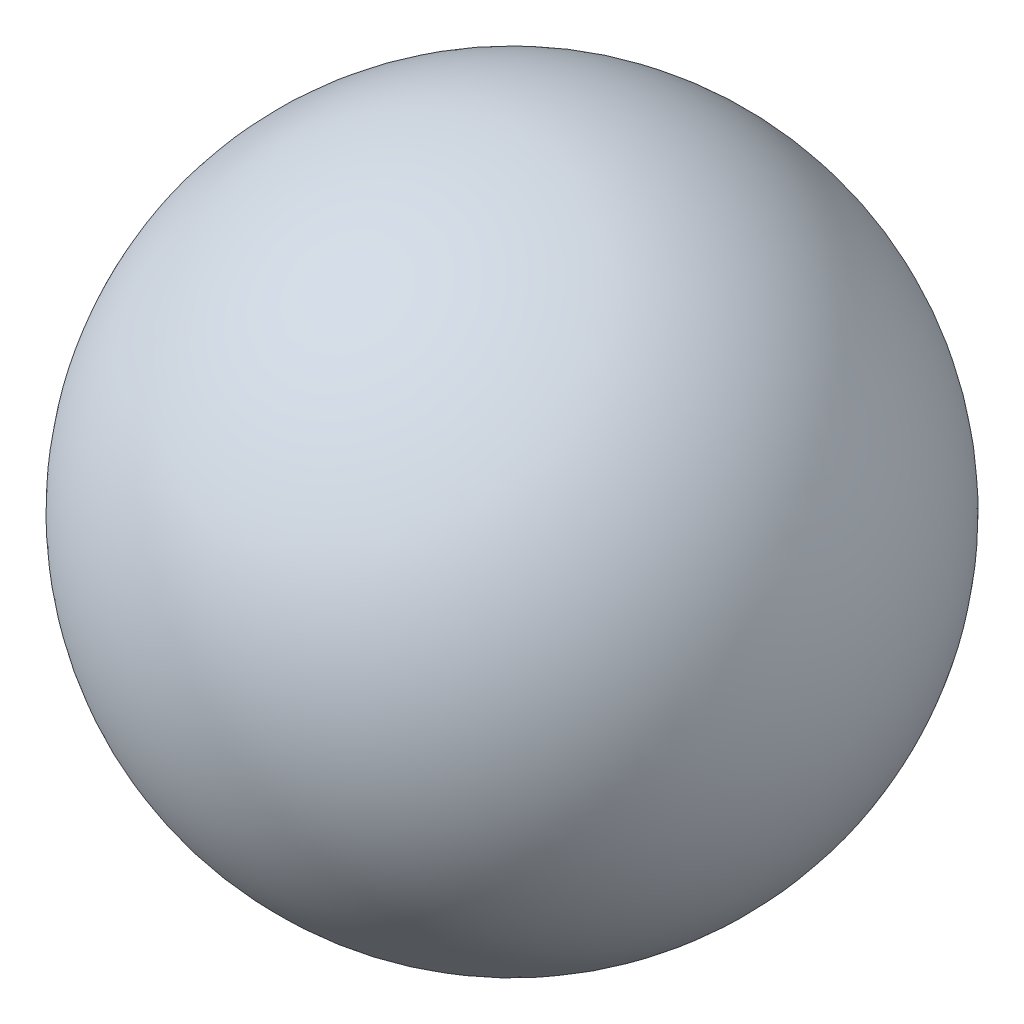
from build123d import *


with BuildPart() as part:
    # Esquisse1 → Base-R_volution (revolve)
    with BuildSketch(Plane(origin=(0, 0, 0), x_dir=(1, 0, 0), z_dir=(0, 1, 0))):
        with BuildLine():
            Line((1.9, 4.4), (6.9, 4.4))
            ThreePointArc((6.9, 4.4), (4.4, 6.9), (1.9, 4.4))
        make_face()
    revolve(axis=Axis((-0.6, 0, -4.4), (1, 0, 0)))


solid = part.part
